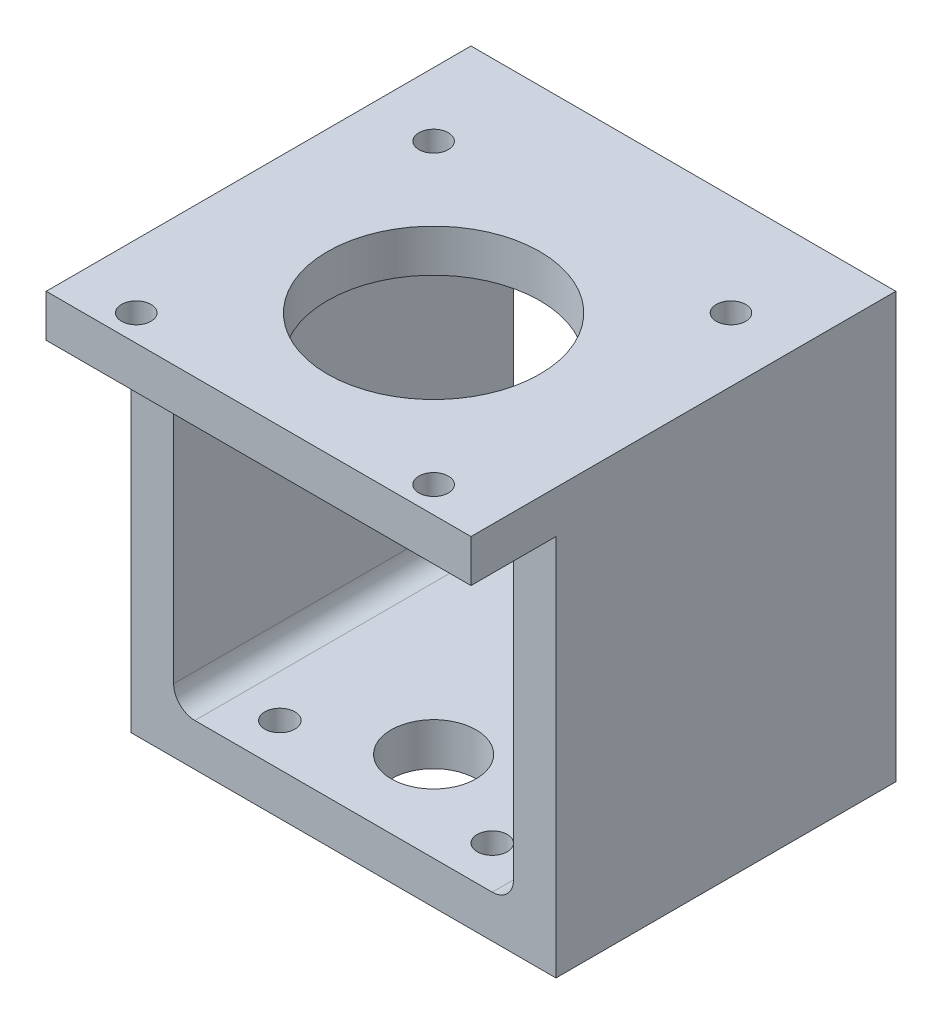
from build123d import *

# Parameters (mm, degrees)
SKETCH2_W                       = 63.5
SKETCH2_H                       = 63.5
EXTRUDE2_DEPTH                  = 63.5
SKETCH3_W                       = 12.7
SKETCH3_H                       = 57.15
EXTRUDE3_DEPTH                  = 110.985226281
SKETCH4_R                       = 15.875
CUT_EXTRUDE1_DEPTH              = 6.35
SKETCH5_R                       = 6.35
CUT_EXTRUDE2_DEPTH              = 6.35
TAP_DRILL_FOR_8_HELICOIL1_D     = 4.3942
TAP_DRILL_FOR_8_HELICOIL1_DEPTH = 9.144
TAP_DRILL_FOR_8_HELICOIL1_TIP   = 1.320150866
F_8_CLEARANCE_HOLE1_D           = 4.4958
F_8_CLEARANCE_HOLE1_DEPTH       = 9.144
F_8_CLEARANCE_HOLE1_TIP         = 1.350674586
TAP_DRILL_FOR_4_HELICOIL1_D     = 3.048
TAP_DRILL_FOR_4_HELICOIL1_DEPTH = 9.144
TAP_DRILL_FOR_4_HELICOIL1_TIP   = 0.915711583


with BuildPart() as part:
    # Sketch2 → Extrude2 (new body)
    with BuildSketch(Plane.XY):
        with Locations((31.75, 31.75)):
            Rectangle(SKETCH2_W, SKETCH2_H)
        with BuildLine():
            Line((9.525, 57.15), (53.975, 57.15))
            ThreePointArc((53.975, 57.15), (56.22006403, 56.22006403), (57.15, 53.975))
            Line((57.15, 53.975), (57.15, 9.525))
            ThreePointArc((57.15, 9.525), (56.22006403, 7.27993597), (53.975, 6.35))
            Line((53.975, 6.35), (9.525, 6.35))
            ThreePointArc((9.525, 6.35), (7.27993597, 7.27993597), (6.35, 9.525))
            Line((6.35, 9.525), (6.35, 53.975))
            ThreePointArc((6.35, 53.975), (7.27993597, 56.22006403), (9.525, 57.15))
        make_face(mode=Mode.SUBTRACT)
    extrude(amount=-EXTRUDE2_DEPTH)

    # Sketch3 → Extrude3 (cut, through all)
    with BuildSketch(Plane(origin=(63.5, 0, 0), x_dir=(0, 0, -1), z_dir=(1, 0, 0))):
        with Locations((6.35, 28.575)):
            Rectangle(SKETCH3_W, SKETCH3_H)
    extrude(amount=-EXTRUDE3_DEPTH, mode=Mode.SUBTRACT)

    # Sketch4 → Cut-Extrude1 (cut)
    with BuildSketch(Plane(origin=(0, 63.5, 0), x_dir=(-1, 0, 0), z_dir=(0, 1, 0))):
        with Locations(Location((-31.75, -26.162, 0), (0, 0, 90))):
            Circle(SKETCH4_R)
    extrude(amount=-CUT_EXTRUDE1_DEPTH, mode=Mode.SUBTRACT)

    # Sketch5 → Cut-Extrude2 (cut)
    with BuildSketch(Plane(origin=(0, 6.35, 0), x_dir=(-1, 0, 0), z_dir=(0, 1, 0))):
        with Locations((-31.75, -26.162)):
            Circle(SKETCH5_R)
    extrude(amount=-CUT_EXTRUDE2_DEPTH, mode=Mode.SUBTRACT)

    # Tap Drill for _8 Helicoil1
    with Locations(Plane(origin=(9.525, 63.5, -48.387), x_dir=(0, 0, 1), z_dir=(0, 1, 0))):
        with Locations((0, 0), (44.45, 0), (0, 44.45), (44.45, 44.45)):
            Hole(TAP_DRILL_FOR_8_HELICOIL1_D / 2, depth=TAP_DRILL_FOR_8_HELICOIL1_DEPTH)
            with Locations((0, 0, -(TAP_DRILL_FOR_8_HELICOIL1_DEPTH + TAP_DRILL_FOR_8_HELICOIL1_TIP / 2))):  # 118° drill point
                Cone(0, TAP_DRILL_FOR_8_HELICOIL1_D / 2, TAP_DRILL_FOR_8_HELICOIL1_TIP, mode=Mode.SUBTRACT)

    # 8 Clearance Hole1
    with Locations(Plane(origin=(15.875, 0, -19.05), x_dir=(0, 0, -1), z_dir=(0, -1, 0))):
        with Locations((0, 0), (38.1, 0), (38.1, 31.75), (0, 31.75)):
            Hole(F_8_CLEARANCE_HOLE1_D / 2, depth=F_8_CLEARANCE_HOLE1_DEPTH)
            with Locations((0, 0, -(F_8_CLEARANCE_HOLE1_DEPTH + F_8_CLEARANCE_HOLE1_TIP / 2))):  # 118° drill point
                Cone(0, F_8_CLEARANCE_HOLE1_D / 2, F_8_CLEARANCE_HOLE1_TIP, mode=Mode.SUBTRACT)

    # Tap Drill for _4 Helicoil1
    with Locations(Plane(origin=(60.325, 60.325, -63.5), x_dir=(-1, 0, 0), z_dir=(0, 0, -1))):
        with Locations((0, 0), (57.15, 0), (57.15, -57.15), (0, -57.15)):
            Hole(TAP_DRILL_FOR_4_HELICOIL1_D / 2, depth=TAP_DRILL_FOR_4_HELICOIL1_DEPTH)
            with Locations((0, 0, -(TAP_DRILL_FOR_4_HELICOIL1_DEPTH + TAP_DRILL_FOR_4_HELICOIL1_TIP / 2))):  # 118° drill point
                Cone(0, TAP_DRILL_FOR_4_HELICOIL1_D / 2, TAP_DRILL_FOR_4_HELICOIL1_TIP, mode=Mode.SUBTRACT)


solid = part.part
